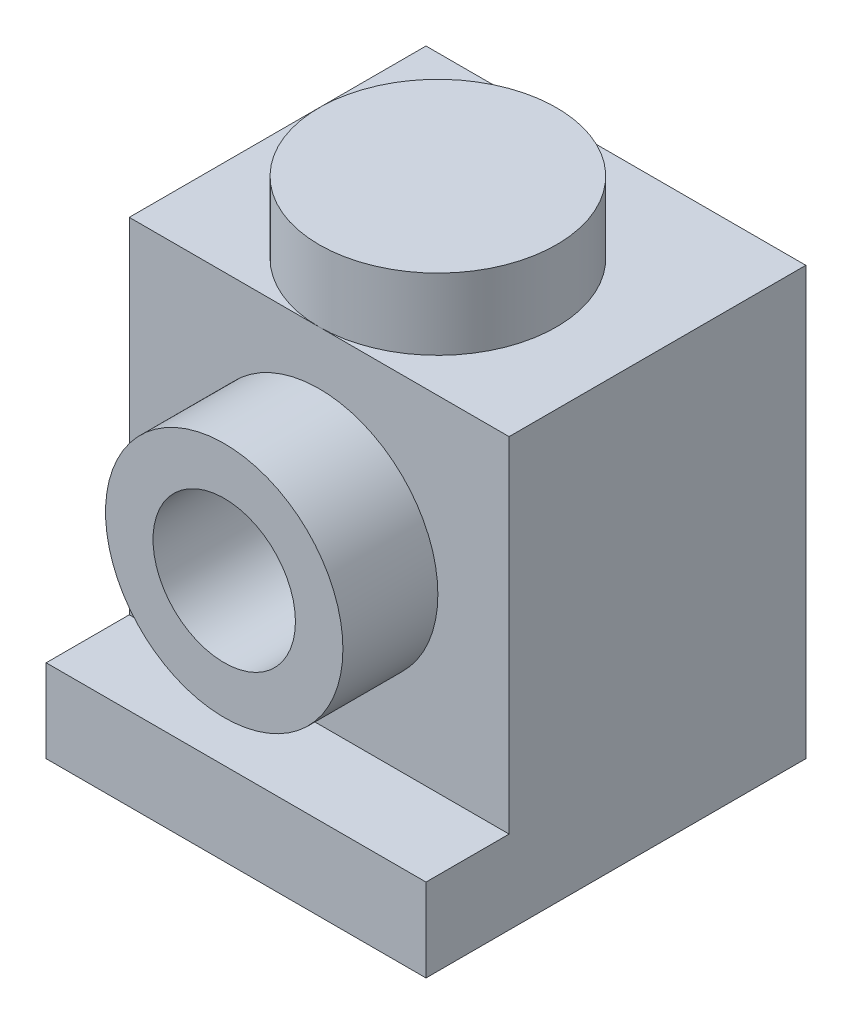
from build123d import *

# Parameters (mm, degrees)
EXTRUSION1_DEPTH        = 8
ESQUISSE3_R             = 2.5
EXTRUSION2_DEPTH        = 1.5
ESQUISSE4_W             = 5
ESQUISSE4_H             = 5
ENL_V_MAT_EXTRU_1_DEPTH = 5.75
ESQUISSE5_R             = 2.5
ESQUISSE5_R_2           = 1.5
EXTRUSION3_DEPTH        = 2
ENL_V_START             = -2
ESQUISSE6_R             = 1.5
ENL_V_MAT_EXTRU_2_DEPTH = 2
ESQUISSE7_W             = 5
ESQUISSE7_H             = 5
ENL_V_MAT_EXTRU_3_DEPTH = 1
ENL_V_MAT_EXTRU_4_DEPTH = 0.25
ENL_V_START_2           = -6.5
ESQUISSE9_W             = 5
ESQUISSE9_H             = 3.98590429
ENL_V_MAT_EXTRU_5_DEPTH = 6.5


with BuildPart() as part:
    # Esquisse2 → Extrusion1 (new body)
    with BuildSketch(Plane(origin=(0, 0, 0), x_dir=(0, 0, -1), z_dir=(1, 0, 0))):
        Polygon((0, 0), (8, 0), (8, 9), (1.75, 9), (1.75, 1.75), (0, 1.75), align=None)
    extrude(amount=-EXTRUSION1_DEPTH)

    # Esquisse3 → Extrusion2 (add)
    with BuildSketch(Plane(origin=(0, 9, 0), x_dir=(-1, 0, 0), z_dir=(0, 1, 0))):
        with Locations(Location((4, -4.25, 0), (0, 0, 90))):
            Circle(ESQUISSE3_R)
    extrude(amount=EXTRUSION2_DEPTH)

    # Esquisse4 → Enl_v. mat.-Extru.1 (cut)
    with BuildSketch(Plane(origin=(0, 0, -8), x_dir=(-1, 0, 0), z_dir=(0, 0, -1))):
        with Locations((4, 5)):
            Rectangle(ESQUISSE4_W, ESQUISSE4_H)
    extrude(amount=-ENL_V_MAT_EXTRU_1_DEPTH, mode=Mode.SUBTRACT)

    # Esquisse5 → Extrusion3 (add)
    with BuildSketch(Plane.XY.offset(-1.75)):
        with Locations((-4, 5.375)):
            Circle(ESQUISSE5_R)
        with Locations((-4, 5.375)):
            Circle(ESQUISSE5_R_2, mode=Mode.SUBTRACT)
    extrude(amount=EXTRUSION3_DEPTH)

    # Esquisse6 → Enl_v. mat.-Extru.2 (cut)
    with BuildSketch(Plane.XY.offset(-1.75).offset(ENL_V_START)):
        with Locations(Location((-4, 5.375, 0), (0, 0, 90))):
            Circle(ESQUISSE6_R)
    extrude(amount=ENL_V_MAT_EXTRU_2_DEPTH, mode=Mode.SUBTRACT)

    # Esquisse7 → Enl_v. mat.-Extru.3 (cut)
    with BuildSketch(Plane.XZ):
        with Locations((-4, -4)):
            Rectangle(ESQUISSE7_W, ESQUISSE7_H)
    extrude(amount=-ENL_V_MAT_EXTRU_3_DEPTH, mode=Mode.SUBTRACT)

    # Esquisse8 → Enl_v. mat.-Extru.4 (cut)
    with BuildSketch(Plane.XZ.offset(-1)):
        with BuildLine():
            Line((-1.5, -6), (-6.5, -6))
            ThreePointArc((-6.5, -6), (-4, -6.5), (-1.5, -6))
        make_face()
        with BuildLine():
            Line((-1.5, -2), (-6.5, -2))
            ThreePointArc((-6.5, -2), (-4, -1.5), (-1.5, -2))
        make_face()
    extrude(amount=-ENL_V_MAT_EXTRU_4_DEPTH, mode=Mode.SUBTRACT)

    # Esquisse9 → Enl_v. mat.-Extru.5 (cut)
    with BuildSketch(Plane.XZ.offset(-1).offset(ENL_V_START_2)):
        with Locations((-4, -4.007047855)):
            Rectangle(ESQUISSE9_W, ESQUISSE9_H)
    extrude(amount=ENL_V_MAT_EXTRU_5_DEPTH, mode=Mode.SUBTRACT)


solid = part.part
